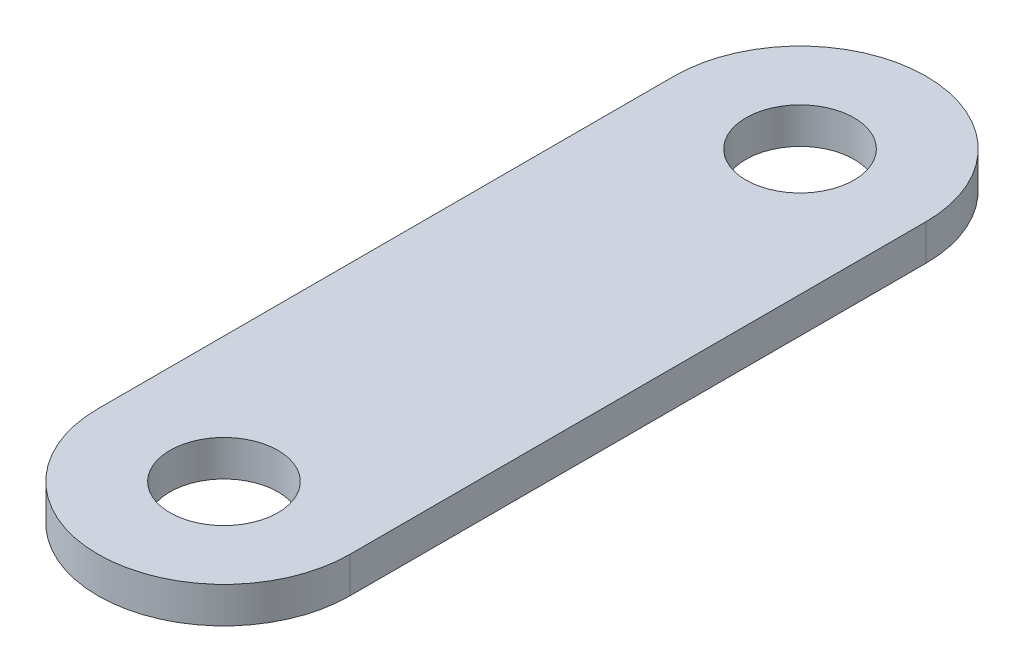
ISO-10303-21;
HEADER;
FILE_DESCRIPTION(('STEP AP214'),'2;1');
FILE_NAME('part.step','',(''),(''),'','','');
FILE_SCHEMA(('AUTOMOTIVE_DESIGN { 1 0 10303 214 1 1 1 1 }'));
ENDSEC;
DATA;
#1=APPLICATION_CONTEXT('core data for automotive mechanical design processes');
#2=APPLICATION_PROTOCOL_DEFINITION('international standard','automotive_design',2000,#1);
#3=PRODUCT_CONTEXT('',#1,'mechanical');
#4=PRODUCT('Part','Part','',(#3));
#5=PRODUCT_RELATED_PRODUCT_CATEGORY('part','',(#4));
#6=PRODUCT_DEFINITION_FORMATION('','',#4);
#7=PRODUCT_DEFINITION_CONTEXT('part definition',#1,'design');
#8=PRODUCT_DEFINITION('design','',#6,#7);
#9=PRODUCT_DEFINITION_SHAPE('','',#8);
#10=(LENGTH_UNIT() NAMED_UNIT(*) SI_UNIT(.MILLI.,.METRE.));
#11=(NAMED_UNIT(*) PLANE_ANGLE_UNIT() SI_UNIT($,.RADIAN.));
#12=(NAMED_UNIT(*) SI_UNIT($,.STERADIAN.) SOLID_ANGLE_UNIT());
#13=UNCERTAINTY_MEASURE_WITH_UNIT(LENGTH_MEASURE(1.E-05),#10,'distance_accuracy_value','');
#14=(GEOMETRIC_REPRESENTATION_CONTEXT(3) GLOBAL_UNCERTAINTY_ASSIGNED_CONTEXT((#13)) GLOBAL_UNIT_ASSIGNED_CONTEXT((#10,
#11,#12)) REPRESENTATION_CONTEXT('',''));
#15=CARTESIAN_POINT('',(0.,0.,0.));
#16=DIRECTION('',(0.,0.,1.));
#17=DIRECTION('',(1.,0.,0.));
#18=AXIS2_PLACEMENT_3D('',#15,#16,#17);
#19=CARTESIAN_POINT('',(0.,1.,-8.));
#20=DIRECTION('',(0.,-1.,0.));
#21=DIRECTION('',(0.,0.,-1.));
#22=AXIS2_PLACEMENT_3D('',#19,#20,#21);
#23=PLANE('',#22);
#24=CARTESIAN_POINT('',(0.,1.,-8.));
#25=DIRECTION('',(0.,1.,0.));
#26=DIRECTION('',(0.,0.,-1.));
#27=AXIS2_PLACEMENT_3D('',#24,#25,#26);
#28=CIRCLE('',#27,3.5);
#29=CARTESIAN_POINT('',(3.5,1.,-8.));
#30=VERTEX_POINT('',#29);
#31=CARTESIAN_POINT('',(-3.5,1.,-8.));
#32=VERTEX_POINT('',#31);
#33=EDGE_CURVE('E87',#30,#32,#28,.T.);
#34=ORIENTED_EDGE('',*,*,#33,.T.);
#35=DIRECTION('',(0.,0.,1.));
#36=VECTOR('',#35,1.);
#37=CARTESIAN_POINT('',(-3.5,1.,-8.));
#38=LINE('',#37,#36);
#39=CARTESIAN_POINT('',(-3.5,1.,8.));
#40=VERTEX_POINT('',#39);
#41=EDGE_CURVE('E115',#32,#40,#38,.T.);
#42=ORIENTED_EDGE('',*,*,#41,.T.);
#43=CARTESIAN_POINT('',(0.,1.,8.));
#44=DIRECTION('',(0.,-1.,0.));
#45=DIRECTION('',(0.,0.,1.));
#46=AXIS2_PLACEMENT_3D('',#43,#44,#45);
#47=CIRCLE('',#46,3.5);
#48=CARTESIAN_POINT('',(3.5,1.,8.));
#49=VERTEX_POINT('',#48);
#50=EDGE_CURVE('E94',#49,#40,#47,.T.);
#51=ORIENTED_EDGE('',*,*,#50,.F.);
#52=DIRECTION('',(0.,0.,-1.));
#53=VECTOR('',#52,1.);
#54=CARTESIAN_POINT('',(3.5,1.,-8.));
#55=LINE('',#54,#53);
#56=EDGE_CURVE('E54',#49,#30,#55,.T.);
#57=ORIENTED_EDGE('',*,*,#56,.T.);
#58=EDGE_LOOP('',(#34,#42,#51,#57));
#59=FACE_BOUND('',#58,.T.);
#60=CARTESIAN_POINT('',(0.,1.,-8.));
#61=DIRECTION('',(0.,1.,0.));
#62=DIRECTION('',(0.,0.,1.));
#63=AXIS2_PLACEMENT_3D('',#60,#61,#62);
#64=CIRCLE('',#63,1.5);
#65=CARTESIAN_POINT('',(0.,1.,-6.5));
#66=VERTEX_POINT('',#65);
#67=EDGE_CURVE('E109',#66,#66,#64,.T.);
#68=ORIENTED_EDGE('',*,*,#67,.F.);
#69=EDGE_LOOP('',(#68));
#70=FACE_BOUND('',#69,.T.);
#71=CARTESIAN_POINT('',(0.,1.,8.));
#72=DIRECTION('',(0.,-1.,0.));
#73=DIRECTION('',(0.,0.,-1.));
#74=AXIS2_PLACEMENT_3D('',#71,#72,#73);
#75=CIRCLE('',#74,1.5);
#76=CARTESIAN_POINT('',(0.,1.,6.5));
#77=VERTEX_POINT('',#76);
#78=EDGE_CURVE('E99',#77,#77,#75,.T.);
#79=ORIENTED_EDGE('',*,*,#78,.T.);
#80=EDGE_LOOP('',(#79));
#81=FACE_BOUND('',#80,.T.);
#82=ADVANCED_FACE('F37',(#59,#70,#81),#23,.F.);
#83=CARTESIAN_POINT('',(0.,0.,-8.));
#84=DIRECTION('',(0.,-1.,0.));
#85=DIRECTION('',(0.,0.,-1.));
#86=AXIS2_PLACEMENT_3D('',#83,#84,#85);
#87=PLANE('',#86);
#88=CARTESIAN_POINT('',(0.,0.,-8.));
#89=DIRECTION('',(0.,1.,0.));
#90=DIRECTION('',(0.,0.,-1.));
#91=AXIS2_PLACEMENT_3D('',#88,#89,#90);
#92=CIRCLE('',#91,3.5);
#93=CARTESIAN_POINT('',(3.5,0.,-8.));
#94=VERTEX_POINT('',#93);
#95=CARTESIAN_POINT('',(-3.5,0.,-8.));
#96=VERTEX_POINT('',#95);
#97=EDGE_CURVE('E85',#94,#96,#92,.T.);
#98=ORIENTED_EDGE('',*,*,#97,.F.);
#99=DIRECTION('',(0.,0.,-1.));
#100=VECTOR('',#99,1.);
#101=CARTESIAN_POINT('',(3.5,0.,-8.));
#102=LINE('',#101,#100);
#103=CARTESIAN_POINT('',(3.5,0.,8.));
#104=VERTEX_POINT('',#103);
#105=EDGE_CURVE('E79',#104,#94,#102,.T.);
#106=ORIENTED_EDGE('',*,*,#105,.F.);
#107=CARTESIAN_POINT('',(0.,0.,8.));
#108=DIRECTION('',(0.,-1.,0.));
#109=DIRECTION('',(0.,0.,1.));
#110=AXIS2_PLACEMENT_3D('',#107,#108,#109);
#111=CIRCLE('',#110,3.5);
#112=CARTESIAN_POINT('',(-3.5,0.,8.));
#113=VERTEX_POINT('',#112);
#114=EDGE_CURVE('E83',#104,#113,#111,.T.);
#115=ORIENTED_EDGE('',*,*,#114,.T.);
#116=DIRECTION('',(0.,0.,1.));
#117=VECTOR('',#116,1.);
#118=CARTESIAN_POINT('',(-3.5,0.,-8.));
#119=LINE('',#118,#117);
#120=EDGE_CURVE('E66',#96,#113,#119,.T.);
#121=ORIENTED_EDGE('',*,*,#120,.F.);
#122=EDGE_LOOP('',(#98,#106,#115,#121));
#123=FACE_BOUND('',#122,.T.);
#124=CARTESIAN_POINT('',(0.,0.,-8.));
#125=DIRECTION('',(0.,1.,0.));
#126=DIRECTION('',(0.,0.,1.));
#127=AXIS2_PLACEMENT_3D('',#124,#125,#126);
#128=CIRCLE('',#127,1.5);
#129=CARTESIAN_POINT('',(0.,0.,-6.5));
#130=VERTEX_POINT('',#129);
#131=EDGE_CURVE('E108',#130,#130,#128,.T.);
#132=ORIENTED_EDGE('',*,*,#131,.T.);
#133=EDGE_LOOP('',(#132));
#134=FACE_BOUND('',#133,.T.);
#135=CARTESIAN_POINT('',(0.,0.,8.));
#136=DIRECTION('',(0.,-1.,0.));
#137=DIRECTION('',(0.,0.,-1.));
#138=AXIS2_PLACEMENT_3D('',#135,#136,#137);
#139=CIRCLE('',#138,1.5);
#140=CARTESIAN_POINT('',(0.,0.,6.5));
#141=VERTEX_POINT('',#140);
#142=EDGE_CURVE('E103',#141,#141,#139,.T.);
#143=ORIENTED_EDGE('',*,*,#142,.F.);
#144=EDGE_LOOP('',(#143));
#145=FACE_BOUND('',#144,.T.);
#146=ADVANCED_FACE('F80',(#123,#134,#145),#87,.T.);
#147=CARTESIAN_POINT('',(0.,1.,-8.));
#148=DIRECTION('',(0.,-1.,0.));
#149=DIRECTION('',(0.,0.,-1.));
#150=AXIS2_PLACEMENT_3D('',#147,#148,#149);
#151=CYLINDRICAL_SURFACE('',#150,3.5);
#152=ORIENTED_EDGE('',*,*,#97,.T.);
#153=DIRECTION('',(0.,-1.,0.));
#154=VECTOR('',#153,1.);
#155=CARTESIAN_POINT('',(-3.5,1.,-8.));
#156=LINE('',#155,#154);
#157=EDGE_CURVE('E11',#32,#96,#156,.T.);
#158=ORIENTED_EDGE('',*,*,#157,.F.);
#159=ORIENTED_EDGE('',*,*,#33,.F.);
#160=DIRECTION('',(0.,-1.,0.));
#161=VECTOR('',#160,1.);
#162=CARTESIAN_POINT('',(3.5,1.,-8.));
#163=LINE('',#162,#161);
#164=EDGE_CURVE('E46',#30,#94,#163,.T.);
#165=ORIENTED_EDGE('',*,*,#164,.T.);
#166=EDGE_LOOP('',(#152,#158,#159,#165));
#167=FACE_BOUND('',#166,.T.);
#168=ADVANCED_FACE('F39',(#167),#151,.T.);
#169=CARTESIAN_POINT('',(-3.5,1.,-8.));
#170=DIRECTION('',(1.,0.,0.));
#171=DIRECTION('',(0.,0.,-1.));
#172=AXIS2_PLACEMENT_3D('',#169,#170,#171);
#173=PLANE('',#172);
#174=ORIENTED_EDGE('',*,*,#120,.T.);
#175=DIRECTION('',(0.,-1.,0.));
#176=VECTOR('',#175,1.);
#177=CARTESIAN_POINT('',(-3.5,1.,8.));
#178=LINE('',#177,#176);
#179=EDGE_CURVE('E93',#40,#113,#178,.T.);
#180=ORIENTED_EDGE('',*,*,#179,.F.);
#181=ORIENTED_EDGE('',*,*,#41,.F.);
#182=ORIENTED_EDGE('',*,*,#157,.T.);
#183=EDGE_LOOP('',(#174,#180,#181,#182));
#184=FACE_BOUND('',#183,.T.);
#185=ADVANCED_FACE('F124',(#184),#173,.F.);
#186=CARTESIAN_POINT('',(3.5,1.,-8.));
#187=DIRECTION('',(-1.,0.,0.));
#188=DIRECTION('',(0.,0.,1.));
#189=AXIS2_PLACEMENT_3D('',#186,#187,#188);
#190=PLANE('',#189);
#191=ORIENTED_EDGE('',*,*,#105,.T.);
#192=ORIENTED_EDGE('',*,*,#164,.F.);
#193=ORIENTED_EDGE('',*,*,#56,.F.);
#194=DIRECTION('',(0.,-1.,0.));
#195=VECTOR('',#194,1.);
#196=CARTESIAN_POINT('',(3.5,1.,8.));
#197=LINE('',#196,#195);
#198=EDGE_CURVE('E89',#49,#104,#197,.T.);
#199=ORIENTED_EDGE('',*,*,#198,.T.);
#200=EDGE_LOOP('',(#191,#192,#193,#199));
#201=FACE_BOUND('',#200,.T.);
#202=ADVANCED_FACE('F90',(#201),#190,.F.);
#203=CARTESIAN_POINT('',(0.,1.,-8.));
#204=DIRECTION('',(0.,-1.,0.));
#205=DIRECTION('',(0.,0.,-1.));
#206=AXIS2_PLACEMENT_3D('',#203,#204,#205);
#207=CYLINDRICAL_SURFACE('',#206,1.5);
#208=ORIENTED_EDGE('',*,*,#67,.T.);
#209=EDGE_LOOP('',(#208));
#210=FACE_BOUND('',#209,.T.);
#211=ORIENTED_EDGE('',*,*,#131,.F.);
#212=EDGE_LOOP('',(#211));
#213=FACE_BOUND('',#212,.T.);
#214=ADVANCED_FACE('F130',(#210,#213),#207,.F.);
#215=CARTESIAN_POINT('',(0.,1.,8.));
#216=DIRECTION('',(0.,-1.,0.));
#217=DIRECTION('',(0.,0.,1.));
#218=AXIS2_PLACEMENT_3D('',#215,#216,#217);
#219=CYLINDRICAL_SURFACE('',#218,3.5);
#220=ORIENTED_EDGE('',*,*,#114,.F.);
#221=ORIENTED_EDGE('',*,*,#198,.F.);
#222=ORIENTED_EDGE('',*,*,#50,.T.);
#223=ORIENTED_EDGE('',*,*,#179,.T.);
#224=EDGE_LOOP('',(#220,#221,#222,#223));
#225=FACE_BOUND('',#224,.T.);
#226=ADVANCED_FACE('F97',(#225),#219,.T.);
#227=CARTESIAN_POINT('',(0.,1.,8.));
#228=DIRECTION('',(0.,-1.,0.));
#229=DIRECTION('',(0.,0.,1.));
#230=AXIS2_PLACEMENT_3D('',#227,#228,#229);
#231=CYLINDRICAL_SURFACE('',#230,1.5);
#232=ORIENTED_EDGE('',*,*,#78,.F.);
#233=EDGE_LOOP('',(#232));
#234=FACE_BOUND('',#233,.T.);
#235=ORIENTED_EDGE('',*,*,#142,.T.);
#236=EDGE_LOOP('',(#235));
#237=FACE_BOUND('',#236,.T.);
#238=ADVANCED_FACE('F144',(#234,#237),#231,.F.);
#239=CLOSED_SHELL('',(#82,#146,#168,#185,#202,#214,#226,#238));
#240=MANIFOLD_SOLID_BREP('B2',#239);
#241=ADVANCED_BREP_SHAPE_REPRESENTATION('',(#18,#240),#14);
#242=SHAPE_DEFINITION_REPRESENTATION(#9,#241);
ENDSEC;
END-ISO-10303-21;
